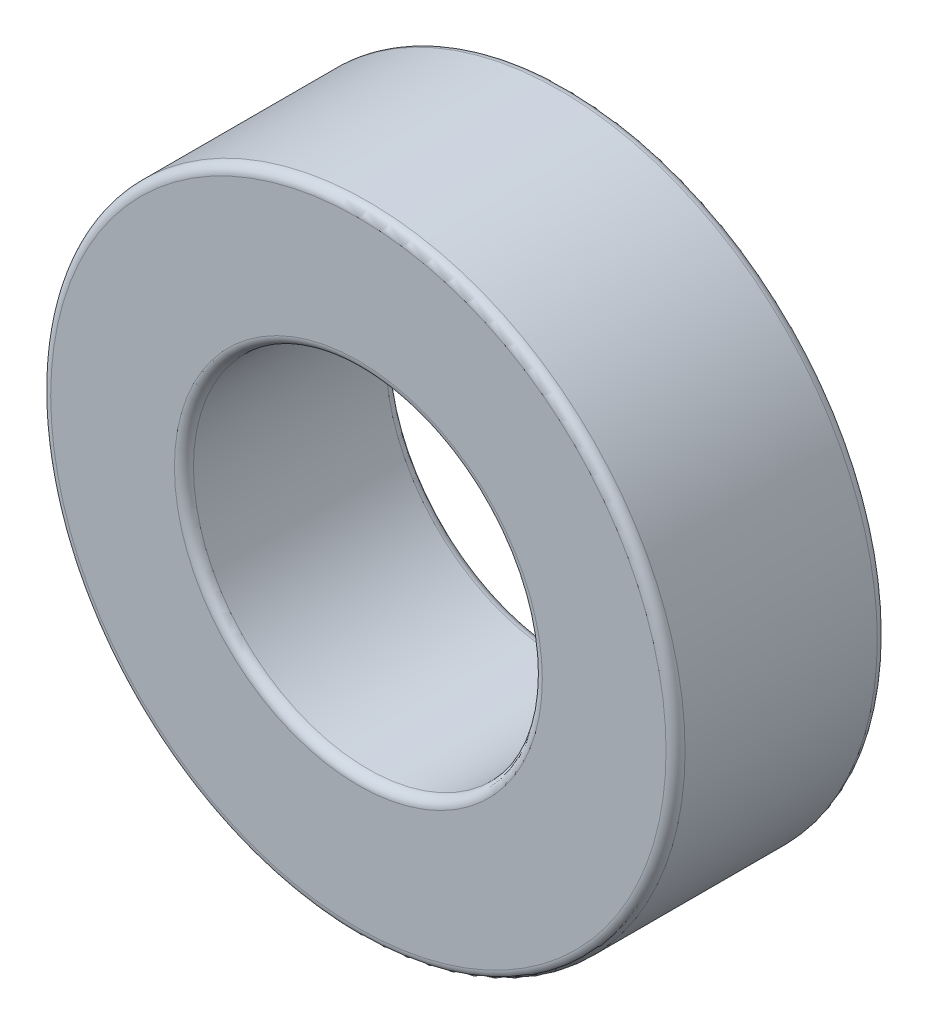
from build123d import *


with BuildPart() as part:
    # E_corps → Corps (revolve)
    with BuildSketch(Plane(origin=(0, 0, 0), x_dir=(0, 0, -1), z_dir=(1, 0, 0)), mode=Mode.PRIVATE) as corps_sk:
        with BuildLine():
            Line((31.8, 50), (1.5, 50))
            ThreePointArc((1.5, 50), (0.439339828, 49.560660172), (0, 48.5))
            Line((0, 48.5), (0, 29))
            ThreePointArc((0, 29), (0.439339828, 27.939339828), (1.5, 27.5))
            Line((1.5, 27.5), (31.8, 27.5))
            ThreePointArc((31.8, 27.5), (32.860660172, 27.939339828), (33.3, 29))
            Line((33.3, 29), (33.3, 48.5))
            ThreePointArc((33.3, 48.5), (32.860660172, 49.560660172), (31.8, 50))
        make_face()
    revolve(corps_sk.sketch.rotate(Axis((0, 0, 112.247372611), (0, 0, -1)), 90), axis=Axis((0, 0, 112.247372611), (0, 0, -1)))

    # E_symbole → Symbole (revolve, cut)
    with BuildSketch(Plane(origin=(0, 0, 0), x_dir=(0, 0, -1), z_dir=(1, 0, 0)), mode=Mode.PRIVATE) as symbole_sk:
        Polygon((16.65, 38.755814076), (9.996851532, 42.703878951), (12.118525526, 46.279253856), (12.109925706, 46.284357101), (9.988251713, 42.708982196), (3.335103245, 46.657047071), (3.33, 46.648447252), (9.983148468, 42.700382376), (7.861474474, 39.125007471), (7.870074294, 39.119904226), (9.991748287, 42.695279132), (16.65, 38.744185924), (23.308251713, 42.695279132), (25.429925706, 39.119904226), (25.438525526, 39.125007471), (23.316851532, 42.700382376), (29.97, 46.648447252), (29.964896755, 46.657047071), (23.311748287, 42.708982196), (21.190074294, 46.284357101), (21.181474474, 46.279253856), (23.303148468, 42.703878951), align=None)
    revolve(symbole_sk.sketch.rotate(Axis((0, 0, -16.65), (0, 0, 1)), 270), axis=Axis((0, 0, -16.65), (0, 0, 1)), mode=Mode.SUBTRACT)


solid = part.part
